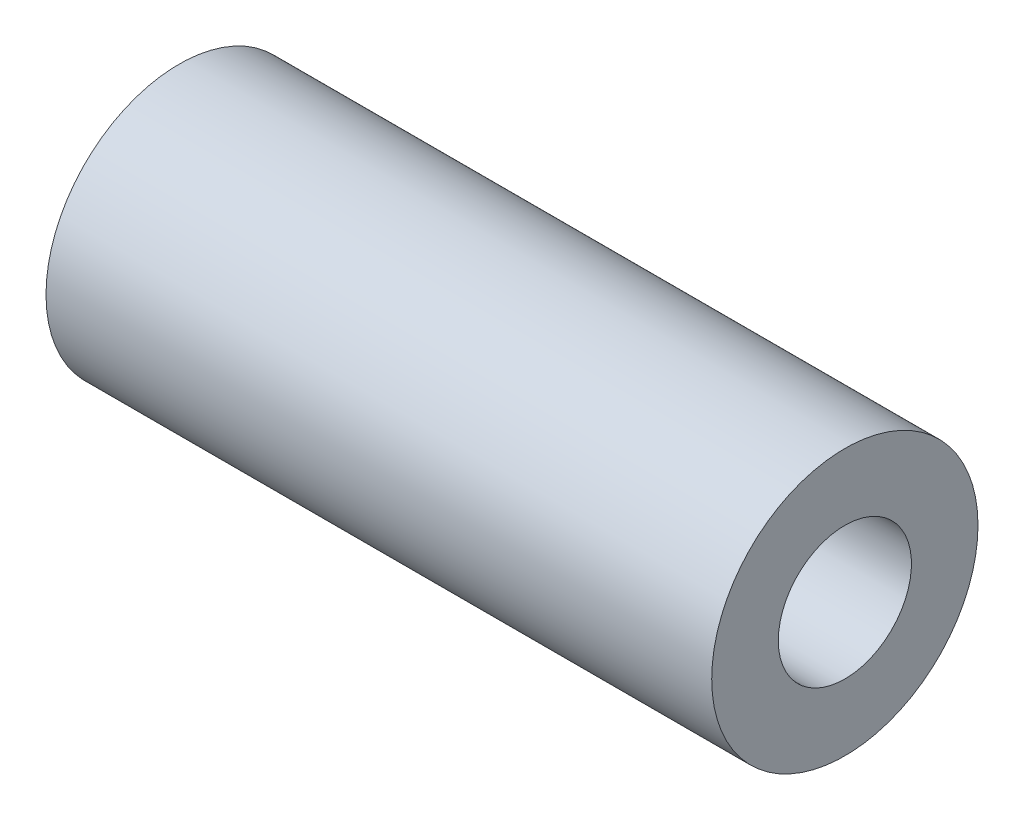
from build123d import *

# Parameters (mm, degrees)
SKIZZE1_W = 50
SKIZZE1_H = 5


with BuildPart() as part:
    # Skizze1 → Rotation1 (revolve)
    with BuildSketch(Plane.XY, mode=Mode.PRIVATE) as rotation1_sk:
        with Locations((25, 16.770430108)):
            Rectangle(SKIZZE1_W, SKIZZE1_H)
    revolve(rotation1_sk.sketch.rotate(Axis((0, 9.270430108, 0), (1, 0, 0)), 90), axis=Axis((0, 9.270430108, 0), (1, 0, 0)))


solid = part.part
